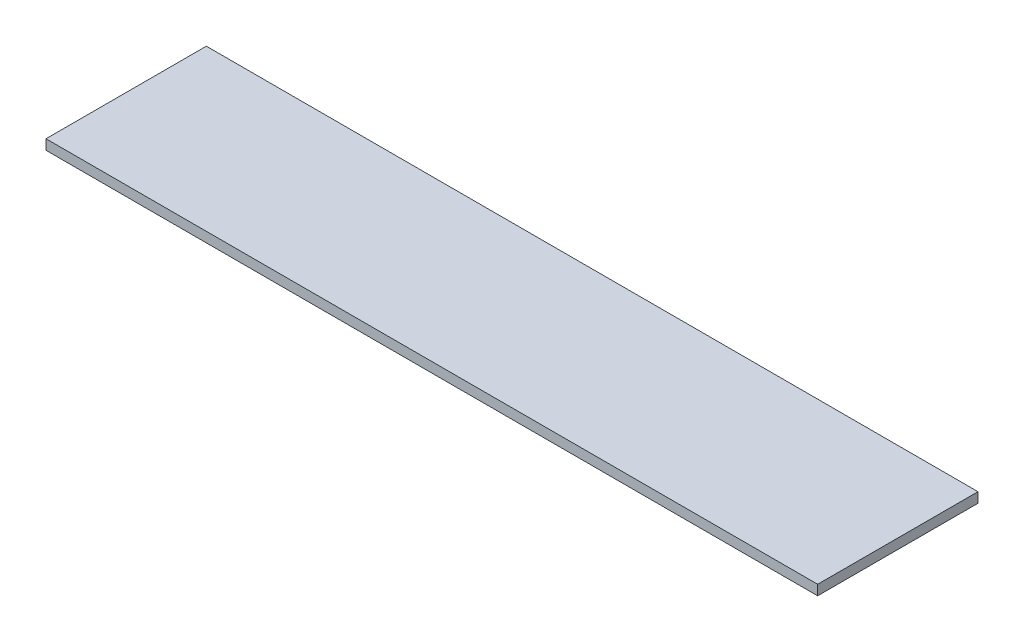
ISO-10303-21;
HEADER;
FILE_DESCRIPTION(('STEP AP214'),'2;1');
FILE_NAME('part.step','',(''),(''),'','','');
FILE_SCHEMA(('AUTOMOTIVE_DESIGN { 1 0 10303 214 1 1 1 1 }'));
ENDSEC;
DATA;
#1=APPLICATION_CONTEXT('core data for automotive mechanical design processes');
#2=APPLICATION_PROTOCOL_DEFINITION('international standard','automotive_design',2000,#1);
#3=PRODUCT_CONTEXT('',#1,'mechanical');
#4=PRODUCT('Part','Part','',(#3));
#5=PRODUCT_RELATED_PRODUCT_CATEGORY('part','',(#4));
#6=PRODUCT_DEFINITION_FORMATION('','',#4);
#7=PRODUCT_DEFINITION_CONTEXT('part definition',#1,'design');
#8=PRODUCT_DEFINITION('design','',#6,#7);
#9=PRODUCT_DEFINITION_SHAPE('','',#8);
#10=(LENGTH_UNIT() NAMED_UNIT(*) SI_UNIT(.MILLI.,.METRE.));
#11=(NAMED_UNIT(*) PLANE_ANGLE_UNIT() SI_UNIT($,.RADIAN.));
#12=(NAMED_UNIT(*) SI_UNIT($,.STERADIAN.) SOLID_ANGLE_UNIT());
#13=UNCERTAINTY_MEASURE_WITH_UNIT(LENGTH_MEASURE(1.E-05),#10,'distance_accuracy_value','');
#14=(GEOMETRIC_REPRESENTATION_CONTEXT(3) GLOBAL_UNCERTAINTY_ASSIGNED_CONTEXT((#13)) GLOBAL_UNIT_ASSIGNED_CONTEXT((#10,
#11,#12)) REPRESENTATION_CONTEXT('',''));
#15=CARTESIAN_POINT('',(0.,0.,0.));
#16=DIRECTION('',(0.,0.,1.));
#17=DIRECTION('',(1.,0.,0.));
#18=AXIS2_PLACEMENT_3D('',#15,#16,#17);
#19=CARTESIAN_POINT('',(770.,10.,160.));
#20=DIRECTION('',(-1.,0.,0.));
#21=DIRECTION('',(0.,0.,1.));
#22=AXIS2_PLACEMENT_3D('',#19,#20,#21);
#23=PLANE('',#22);
#24=DIRECTION('',(0.,0.,-1.));
#25=VECTOR('',#24,1.);
#26=CARTESIAN_POINT('',(770.,-10.,160.));
#27=LINE('',#26,#25);
#28=CARTESIAN_POINT('',(770.,-10.,160.));
#29=VERTEX_POINT('',#28);
#30=CARTESIAN_POINT('',(770.,-10.,-160.));
#31=VERTEX_POINT('',#30);
#32=EDGE_CURVE('E96',#29,#31,#27,.T.);
#33=ORIENTED_EDGE('',*,*,#32,.T.);
#34=DIRECTION('',(0.,-1.,0.));
#35=VECTOR('',#34,1.);
#36=CARTESIAN_POINT('',(770.,10.,-160.));
#37=LINE('',#36,#35);
#38=CARTESIAN_POINT('',(770.,10.,-160.));
#39=VERTEX_POINT('',#38);
#40=EDGE_CURVE('E11',#39,#31,#37,.T.);
#41=ORIENTED_EDGE('',*,*,#40,.F.);
#42=DIRECTION('',(0.,0.,-1.));
#43=VECTOR('',#42,1.);
#44=CARTESIAN_POINT('',(770.,10.,160.));
#45=LINE('',#44,#43);
#46=CARTESIAN_POINT('',(770.,10.,160.));
#47=VERTEX_POINT('',#46);
#48=EDGE_CURVE('E84',#47,#39,#45,.T.);
#49=ORIENTED_EDGE('',*,*,#48,.F.);
#50=DIRECTION('',(0.,-1.,0.));
#51=VECTOR('',#50,1.);
#52=CARTESIAN_POINT('',(770.,10.,160.));
#53=LINE('',#52,#51);
#54=EDGE_CURVE('E92',#47,#29,#53,.T.);
#55=ORIENTED_EDGE('',*,*,#54,.T.);
#56=EDGE_LOOP('',(#33,#41,#49,#55));
#57=FACE_BOUND('',#56,.T.);
#58=ADVANCED_FACE('F33',(#57),#23,.F.);
#59=CARTESIAN_POINT('',(-770.,10.,-160.));
#60=DIRECTION('',(0.,0.,1.));
#61=DIRECTION('',(1.,0.,0.));
#62=AXIS2_PLACEMENT_3D('',#59,#60,#61);
#63=PLANE('',#62);
#64=DIRECTION('',(-1.,0.,0.));
#65=VECTOR('',#64,1.);
#66=CARTESIAN_POINT('',(-770.,-10.,-160.));
#67=LINE('',#66,#65);
#68=CARTESIAN_POINT('',(-770.,-10.,-160.));
#69=VERTEX_POINT('',#68);
#70=EDGE_CURVE('E88',#31,#69,#67,.T.);
#71=ORIENTED_EDGE('',*,*,#70,.T.);
#72=DIRECTION('',(0.,-1.,0.));
#73=VECTOR('',#72,1.);
#74=CARTESIAN_POINT('',(-770.,10.,-160.));
#75=LINE('',#74,#73);
#76=CARTESIAN_POINT('',(-770.,10.,-160.));
#77=VERTEX_POINT('',#76);
#78=EDGE_CURVE('E41',#77,#69,#75,.T.);
#79=ORIENTED_EDGE('',*,*,#78,.F.);
#80=DIRECTION('',(-1.,0.,0.));
#81=VECTOR('',#80,1.);
#82=CARTESIAN_POINT('',(-770.,10.,-160.));
#83=LINE('',#82,#81);
#84=EDGE_CURVE('E79',#39,#77,#83,.T.);
#85=ORIENTED_EDGE('',*,*,#84,.F.);
#86=ORIENTED_EDGE('',*,*,#40,.T.);
#87=EDGE_LOOP('',(#71,#79,#85,#86));
#88=FACE_BOUND('',#87,.T.);
#89=ADVANCED_FACE('F87',(#88),#63,.F.);
#90=CARTESIAN_POINT('',(-770.,10.,160.));
#91=DIRECTION('',(1.,0.,0.));
#92=DIRECTION('',(0.,0.,-1.));
#93=AXIS2_PLACEMENT_3D('',#90,#91,#92);
#94=PLANE('',#93);
#95=DIRECTION('',(0.,0.,1.));
#96=VECTOR('',#95,1.);
#97=CARTESIAN_POINT('',(-770.,-10.,160.));
#98=LINE('',#97,#96);
#99=CARTESIAN_POINT('',(-770.,-10.,160.));
#100=VERTEX_POINT('',#99);
#101=EDGE_CURVE('E66',#69,#100,#98,.T.);
#102=ORIENTED_EDGE('',*,*,#101,.T.);
#103=DIRECTION('',(0.,-1.,0.));
#104=VECTOR('',#103,1.);
#105=CARTESIAN_POINT('',(-770.,10.,160.));
#106=LINE('',#105,#104);
#107=CARTESIAN_POINT('',(-770.,10.,160.));
#108=VERTEX_POINT('',#107);
#109=EDGE_CURVE('E89',#108,#100,#106,.T.);
#110=ORIENTED_EDGE('',*,*,#109,.F.);
#111=DIRECTION('',(0.,0.,1.));
#112=VECTOR('',#111,1.);
#113=CARTESIAN_POINT('',(-770.,10.,160.));
#114=LINE('',#113,#112);
#115=EDGE_CURVE('E82',#77,#108,#114,.T.);
#116=ORIENTED_EDGE('',*,*,#115,.F.);
#117=ORIENTED_EDGE('',*,*,#78,.T.);
#118=EDGE_LOOP('',(#102,#110,#116,#117));
#119=FACE_BOUND('',#118,.T.);
#120=ADVANCED_FACE('F90',(#119),#94,.F.);
#121=CARTESIAN_POINT('',(-770.,10.,160.));
#122=DIRECTION('',(0.,0.,-1.));
#123=DIRECTION('',(-1.,0.,0.));
#124=AXIS2_PLACEMENT_3D('',#121,#122,#123);
#125=PLANE('',#124);
#126=DIRECTION('',(1.,0.,0.));
#127=VECTOR('',#126,1.);
#128=CARTESIAN_POINT('',(-770.,-10.,160.));
#129=LINE('',#128,#127);
#130=EDGE_CURVE('E72',#100,#29,#129,.T.);
#131=ORIENTED_EDGE('',*,*,#130,.T.);
#132=ORIENTED_EDGE('',*,*,#54,.F.);
#133=DIRECTION('',(1.,0.,0.));
#134=VECTOR('',#133,1.);
#135=CARTESIAN_POINT('',(-770.,10.,160.));
#136=LINE('',#135,#134);
#137=EDGE_CURVE('E49',#108,#47,#136,.T.);
#138=ORIENTED_EDGE('',*,*,#137,.F.);
#139=ORIENTED_EDGE('',*,*,#109,.T.);
#140=EDGE_LOOP('',(#131,#132,#138,#139));
#141=FACE_BOUND('',#140,.T.);
#142=ADVANCED_FACE('F103',(#141),#125,.F.);
#143=CARTESIAN_POINT('',(0.,10.,0.));
#144=DIRECTION('',(0.,-1.,0.));
#145=DIRECTION('',(0.,0.,-1.));
#146=AXIS2_PLACEMENT_3D('',#143,#144,#145);
#147=PLANE('',#146);
#148=ORIENTED_EDGE('',*,*,#48,.T.);
#149=ORIENTED_EDGE('',*,*,#84,.T.);
#150=ORIENTED_EDGE('',*,*,#115,.T.);
#151=ORIENTED_EDGE('',*,*,#137,.T.);
#152=EDGE_LOOP('',(#148,#149,#150,#151));
#153=FACE_BOUND('',#152,.T.);
#154=ADVANCED_FACE('F80',(#153),#147,.F.);
#155=CARTESIAN_POINT('',(0.,-10.,0.));
#156=DIRECTION('',(0.,-1.,0.));
#157=DIRECTION('',(0.,0.,-1.));
#158=AXIS2_PLACEMENT_3D('',#155,#156,#157);
#159=PLANE('',#158);
#160=ORIENTED_EDGE('',*,*,#32,.F.);
#161=ORIENTED_EDGE('',*,*,#130,.F.);
#162=ORIENTED_EDGE('',*,*,#101,.F.);
#163=ORIENTED_EDGE('',*,*,#70,.F.);
#164=EDGE_LOOP('',(#160,#161,#162,#163));
#165=FACE_BOUND('',#164,.T.);
#166=ADVANCED_FACE('F106',(#165),#159,.T.);
#167=CLOSED_SHELL('',(#58,#89,#120,#142,#154,#166));
#168=MANIFOLD_SOLID_BREP('B2',#167);
#169=ADVANCED_BREP_SHAPE_REPRESENTATION('',(#18,#168),#14);
#170=SHAPE_DEFINITION_REPRESENTATION(#9,#169);
ENDSEC;
END-ISO-10303-21;
